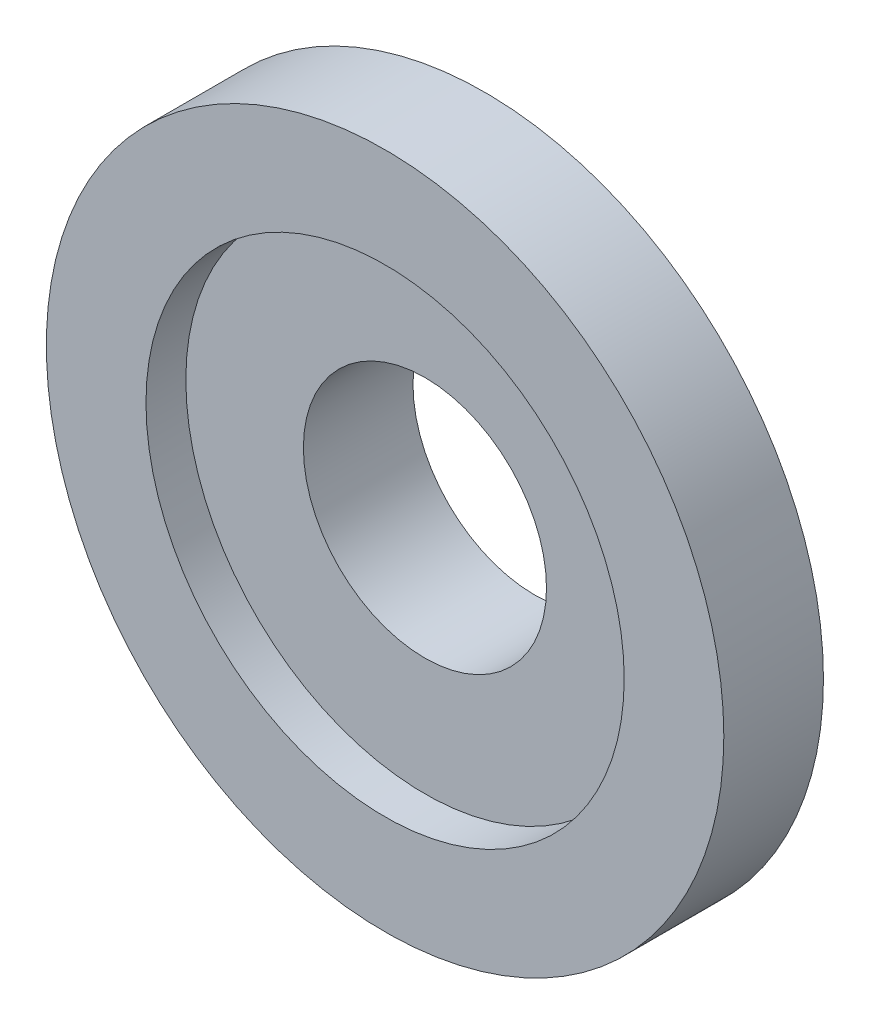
from build123d import *

# Parameters (mm, degrees)
SKETCH_1_R          = 17
EXTRUDE_1_DEPTH     = 3
SKETCH_2_R          = 7.5
SKETCH_2_R_2        = 6.1
EXTRUDE_2_DEPTH     = 2.5
SKETCH_3_R          = 6.1
CUT_EXTRUDE_1_DEPTH = 25.66272491
SKETCH_4_R          = 12
SKETCH_4_R_2        = 10
CUT_EXTRUDE_2_DEPTH = 0.2
SKETCH_5_R          = 17
SKETCH_5_R_2        = 12
EXTRUDE_3_DEPTH     = 2


with BuildPart() as part:
    # Sketch 1 → Extrude 1 (new body)
    with BuildSketch(Plane.XY):
        Circle(SKETCH_1_R)
    extrude(amount=EXTRUDE_1_DEPTH)

    # Sketch 2 → Extrude 2 (add)
    with BuildSketch(Plane(origin=(0, 0, 0), x_dir=(-1, 0, 0), z_dir=(0, 0, -1))):
        with Locations(Location((0, 0, 0), (0, 0, 180))):
            Circle(SKETCH_2_R)
        Circle(SKETCH_2_R_2, mode=Mode.SUBTRACT)
    extrude(amount=EXTRUDE_2_DEPTH)

    # Sketch 3 → Cut-Extrude 1 (cut, through all)
    with BuildSketch(Plane(origin=(0, 0, -2.5), x_dir=(-1, 0, 0), z_dir=(0, 0, -1))):
        Circle(SKETCH_3_R)
    extrude(amount=-CUT_EXTRUDE_1_DEPTH, mode=Mode.SUBTRACT)

    # Sketch 4 → Cut-Extrude 2 (cut)
    with BuildSketch(Plane(origin=(0, 0, 0), x_dir=(-1, 0, 0), z_dir=(0, 0, -1))):
        Circle(SKETCH_4_R)
        Circle(SKETCH_4_R_2, mode=Mode.SUBTRACT)
    extrude(amount=-CUT_EXTRUDE_2_DEPTH, mode=Mode.SUBTRACT)

    # Sketch 5 → Extrude 3 (add)
    with BuildSketch(Plane.XY.offset(3)):
        Circle(SKETCH_5_R)
        with Locations(Location((0, 0, 0), (0, 0, 180))):
            Circle(SKETCH_5_R_2, mode=Mode.SUBTRACT)
    extrude(amount=EXTRUDE_3_DEPTH)


solid = part.part
